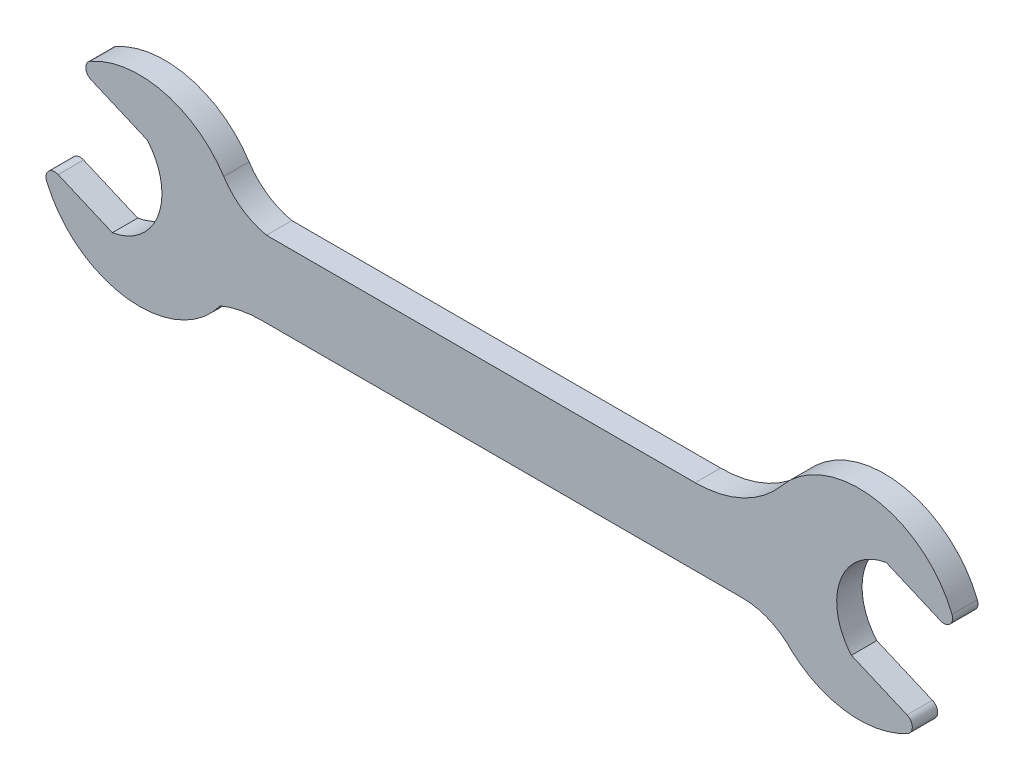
ISO-10303-21;
HEADER;
FILE_DESCRIPTION(('STEP AP214'),'2;1');
FILE_NAME('part.step','',(''),(''),'','','');
FILE_SCHEMA(('AUTOMOTIVE_DESIGN { 1 0 10303 214 1 1 1 1 }'));
ENDSEC;
DATA;
#1=APPLICATION_CONTEXT('core data for automotive mechanical design processes');
#2=APPLICATION_PROTOCOL_DEFINITION('international standard','automotive_design',2000,#1);
#3=PRODUCT_CONTEXT('',#1,'mechanical');
#4=PRODUCT('Part','Part','',(#3));
#5=PRODUCT_RELATED_PRODUCT_CATEGORY('part','',(#4));
#6=PRODUCT_DEFINITION_FORMATION('','',#4);
#7=PRODUCT_DEFINITION_CONTEXT('part definition',#1,'design');
#8=PRODUCT_DEFINITION('design','',#6,#7);
#9=PRODUCT_DEFINITION_SHAPE('','',#8);
#10=(LENGTH_UNIT() NAMED_UNIT(*) SI_UNIT(.MILLI.,.METRE.));
#11=(NAMED_UNIT(*) PLANE_ANGLE_UNIT() SI_UNIT($,.RADIAN.));
#12=(NAMED_UNIT(*) SI_UNIT($,.STERADIAN.) SOLID_ANGLE_UNIT());
#13=UNCERTAINTY_MEASURE_WITH_UNIT(LENGTH_MEASURE(1.E-05),#10,'distance_accuracy_value','');
#14=(GEOMETRIC_REPRESENTATION_CONTEXT(3) GLOBAL_UNCERTAINTY_ASSIGNED_CONTEXT((#13)) GLOBAL_UNIT_ASSIGNED_CONTEXT((#10,
#11,#12)) REPRESENTATION_CONTEXT('',''));
#15=CARTESIAN_POINT('',(0.,0.,0.));
#16=DIRECTION('',(0.,0.,1.));
#17=DIRECTION('',(1.,0.,0.));
#18=AXIS2_PLACEMENT_3D('',#15,#16,#17);
#19=CARTESIAN_POINT('',(66.7513893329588,243.610456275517,9.525));
#20=DIRECTION('',(0.,0.,-1.));
#21=DIRECTION('',(-1.,0.,0.));
#22=AXIS2_PLACEMENT_3D('',#19,#20,#21);
#23=CYLINDRICAL_SURFACE('',#22,75.26879536);
#24=CARTESIAN_POINT('',(66.7513893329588,243.610456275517,-9.525));
#25=DIRECTION('',(0.,0.,1.));
#26=DIRECTION('',(1.,0.,0.));
#27=AXIS2_PLACEMENT_3D('',#24,#25,#26);
#28=CIRCLE('',#27,75.26879536);
#29=CARTESIAN_POINT('',(16.9197315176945,187.199487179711,-9.525));
#30=VERTEX_POINT('',#29);
#31=CARTESIAN_POINT('',(103.374509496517,177.852273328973,-9.525));
#32=VERTEX_POINT('',#31);
#33=EDGE_CURVE('E172',#30,#32,#28,.T.);
#34=ORIENTED_EDGE('',*,*,#33,.T.);
#35=DIRECTION('',(0.,0.,-1.));
#36=VECTOR('',#35,1.);
#37=CARTESIAN_POINT('',(103.374509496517,177.852273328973,9.525));
#38=LINE('',#37,#36);
#39=CARTESIAN_POINT('',(103.374509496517,177.852273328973,9.525));
#40=VERTEX_POINT('',#39);
#41=EDGE_CURVE('E11',#40,#32,#38,.T.);
#42=ORIENTED_EDGE('',*,*,#41,.F.);
#43=CARTESIAN_POINT('',(66.7513893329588,243.610456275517,9.525));
#44=DIRECTION('',(0.,0.,1.));
#45=DIRECTION('',(1.,0.,0.));
#46=AXIS2_PLACEMENT_3D('',#43,#44,#45);
#47=CIRCLE('',#46,75.26879536);
#48=CARTESIAN_POINT('',(16.9197315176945,187.199487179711,9.525));
#49=VERTEX_POINT('',#48);
#50=EDGE_CURVE('E223',#49,#40,#47,.T.);
#51=ORIENTED_EDGE('',*,*,#50,.F.);
#52=DIRECTION('',(0.,0.,-1.));
#53=VECTOR('',#52,1.);
#54=CARTESIAN_POINT('',(16.9197315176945,187.199487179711,9.525));
#55=LINE('',#54,#53);
#56=EDGE_CURVE('E185',#49,#30,#55,.T.);
#57=ORIENTED_EDGE('',*,*,#56,.T.);
#58=EDGE_LOOP('',(#34,#42,#51,#57));
#59=FACE_BOUND('',#58,.T.);
#60=ADVANCED_FACE('F32',(#59),#23,.T.);
#61=CARTESIAN_POINT('',(100.189890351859,183.57037619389,9.525));
#62=DIRECTION('',(0.,0.,-1.));
#63=DIRECTION('',(-1.,0.,0.));
#64=AXIS2_PLACEMENT_3D('',#61,#62,#63);
#65=CYLINDRICAL_SURFACE('',#64,6.5451126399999);
#66=CARTESIAN_POINT('',(100.189890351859,183.57037619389,-9.525));
#67=DIRECTION('',(0.,0.,1.));
#68=DIRECTION('',(1.,0.,0.));
#69=AXIS2_PLACEMENT_3D('',#66,#67,#68);
#70=CIRCLE('',#69,6.5451126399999);
#71=CARTESIAN_POINT('',(102.76813653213,189.586283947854,-9.525));
#72=VERTEX_POINT('',#71);
#73=EDGE_CURVE('E168',#32,#72,#70,.T.);
#74=ORIENTED_EDGE('',*,*,#73,.T.);
#75=DIRECTION('',(0.,0.,-1.));
#76=VECTOR('',#75,1.);
#77=CARTESIAN_POINT('',(102.76813653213,189.586283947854,9.525));
#78=LINE('',#77,#76);
#79=CARTESIAN_POINT('',(102.76813653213,189.586283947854,9.525));
#80=VERTEX_POINT('',#79);
#81=EDGE_CURVE('E39',#80,#72,#78,.T.);
#82=ORIENTED_EDGE('',*,*,#81,.F.);
#83=CARTESIAN_POINT('',(100.189890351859,183.57037619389,9.525));
#84=DIRECTION('',(0.,0.,1.));
#85=DIRECTION('',(1.,0.,0.));
#86=AXIS2_PLACEMENT_3D('',#83,#84,#85);
#87=CIRCLE('',#86,6.5451126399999);
#88=EDGE_CURVE('E181',#40,#80,#87,.T.);
#89=ORIENTED_EDGE('',*,*,#88,.F.);
#90=ORIENTED_EDGE('',*,*,#41,.T.);
#91=EDGE_LOOP('',(#74,#82,#89,#90));
#92=FACE_BOUND('',#91,.T.);
#93=ADVANCED_FACE('F180',(#92),#65,.T.);
#94=CARTESIAN_POINT('',(61.0328374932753,207.472840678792,9.525));
#95=DIRECTION('',(-0.393919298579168,-0.919145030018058,0.));
#96=DIRECTION('',(0.919145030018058,-0.393919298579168,0.));
#97=AXIS2_PLACEMENT_3D('',#94,#95,#96);
#98=PLANE('',#97);
#99=DIRECTION('',(-0.919145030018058,0.393919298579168,0.));
#100=VECTOR('',#99,1.);
#101=CARTESIAN_POINT('',(61.0328374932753,207.472840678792,-9.525));
#102=LINE('',#101,#100);
#103=CARTESIAN_POINT('',(61.0328374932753,207.472840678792,-9.525));
#104=VERTEX_POINT('',#103);
#105=EDGE_CURVE('E174',#72,#104,#102,.T.);
#106=ORIENTED_EDGE('',*,*,#105,.T.);
#107=DIRECTION('',(0.,0.,-1.));
#108=VECTOR('',#107,1.);
#109=CARTESIAN_POINT('',(61.0328374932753,207.472840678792,9.525));
#110=LINE('',#109,#108);
#111=CARTESIAN_POINT('',(61.0328374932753,207.472840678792,9.525));
#112=VERTEX_POINT('',#111);
#113=EDGE_CURVE('E309',#112,#104,#110,.T.);
#114=ORIENTED_EDGE('',*,*,#113,.F.);
#115=DIRECTION('',(-0.919145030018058,0.393919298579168,0.));
#116=VECTOR('',#115,1.);
#117=CARTESIAN_POINT('',(61.0328374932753,207.472840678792,9.525));
#118=LINE('',#117,#116);
#119=EDGE_CURVE('E226',#80,#112,#118,.T.);
#120=ORIENTED_EDGE('',*,*,#119,.F.);
#121=ORIENTED_EDGE('',*,*,#81,.T.);
#122=EDGE_LOOP('',(#106,#114,#120,#121));
#123=FACE_BOUND('',#122,.T.);
#124=ADVANCED_FACE('F313',(#123),#98,.F.);
#125=CARTESIAN_POINT('',(94.5765397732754,236.84904688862,9.525));
#126=DIRECTION('',(0.,0.,-1.));
#127=DIRECTION('',(-1.,0.,0.));
#128=AXIS2_PLACEMENT_3D('',#125,#126,#127);
#129=CYLINDRICAL_SURFACE('',#128,44.5885798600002);
#130=CARTESIAN_POINT('',(94.5765397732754,236.84904688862,-9.525));
#131=DIRECTION('',(0.,0.,-1.));
#132=DIRECTION('',(1.,0.,0.));
#133=AXIS2_PLACEMENT_3D('',#130,#131,#132);
#134=CIRCLE('',#133,44.5885798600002);
#135=CARTESIAN_POINT('',(87.1923811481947,280.821943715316,-9.525));
#136=VERTEX_POINT('',#135);
#137=EDGE_CURVE('E189',#104,#136,#134,.T.);
#138=ORIENTED_EDGE('',*,*,#137,.T.);
#139=DIRECTION('',(0.,0.,-1.));
#140=VECTOR('',#139,1.);
#141=CARTESIAN_POINT('',(87.1923811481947,280.821943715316,9.525));
#142=LINE('',#141,#140);
#143=CARTESIAN_POINT('',(87.1923811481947,280.821943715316,9.525));
#144=VERTEX_POINT('',#143);
#145=EDGE_CURVE('E306',#144,#136,#142,.T.);
#146=ORIENTED_EDGE('',*,*,#145,.F.);
#147=CARTESIAN_POINT('',(94.5765397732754,236.84904688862,9.525));
#148=DIRECTION('',(0.,0.,-1.));
#149=DIRECTION('',(1.,0.,0.));
#150=AXIS2_PLACEMENT_3D('',#147,#148,#149);
#151=CIRCLE('',#150,44.5885798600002);
#152=EDGE_CURVE('E228',#112,#144,#151,.T.);
#153=ORIENTED_EDGE('',*,*,#152,.F.);
#154=ORIENTED_EDGE('',*,*,#113,.T.);
#155=EDGE_LOOP('',(#138,#146,#153,#154));
#156=FACE_BOUND('',#155,.T.);
#157=ADVANCED_FACE('F321',(#156),#129,.F.);
#158=CARTESIAN_POINT('',(87.1923811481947,280.821943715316,9.525));
#159=DIRECTION('',(0.393919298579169,0.919145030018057,0.));
#160=DIRECTION('',(-0.919145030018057,0.39391929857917,0.));
#161=AXIS2_PLACEMENT_3D('',#158,#159,#160);
#162=PLANE('',#161);
#163=DIRECTION('',(0.919145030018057,-0.39391929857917,0.));
#164=VECTOR('',#163,1.);
#165=CARTESIAN_POINT('',(87.1923811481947,280.821943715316,-9.525));
#166=LINE('',#165,#164);
#167=CARTESIAN_POINT('',(127.873018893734,263.387384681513,-9.525));
#168=VERTEX_POINT('',#167);
#169=EDGE_CURVE('E191',#136,#168,#166,.T.);
#170=ORIENTED_EDGE('',*,*,#169,.T.);
#171=DIRECTION('',(0.,0.,-1.));
#172=VECTOR('',#171,1.);
#173=CARTESIAN_POINT('',(127.873018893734,263.387384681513,9.525));
#174=LINE('',#173,#172);
#175=CARTESIAN_POINT('',(127.873018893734,263.387384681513,9.525));
#176=VERTEX_POINT('',#175);
#177=EDGE_CURVE('E303',#176,#168,#174,.T.);
#178=ORIENTED_EDGE('',*,*,#177,.F.);
#179=DIRECTION('',(0.919145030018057,-0.39391929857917,0.));
#180=VECTOR('',#179,1.);
#181=CARTESIAN_POINT('',(87.1923811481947,280.821943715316,9.525));
#182=LINE('',#181,#180);
#183=EDGE_CURVE('E230',#144,#176,#182,.T.);
#184=ORIENTED_EDGE('',*,*,#183,.F.);
#185=ORIENTED_EDGE('',*,*,#145,.T.);
#186=EDGE_LOOP('',(#170,#178,#184,#185));
#187=FACE_BOUND('',#186,.T.);
#188=ADVANCED_FACE('F324',(#187),#162,.F.);
#189=CARTESIAN_POINT('',(130.451265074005,269.403292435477,9.525));
#190=DIRECTION('',(0.,0.,-1.));
#191=DIRECTION('',(-1.,0.,0.));
#192=AXIS2_PLACEMENT_3D('',#189,#190,#191);
#193=CYLINDRICAL_SURFACE('',#192,6.54511263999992);
#194=CARTESIAN_POINT('',(130.451265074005,269.403292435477,-9.525));
#195=DIRECTION('',(0.,0.,1.));
#196=DIRECTION('',(-1.,0.,0.));
#197=AXIS2_PLACEMENT_3D('',#194,#195,#196);
#198=CIRCLE('',#197,6.54511263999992);
#199=CARTESIAN_POINT('',(136.517919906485,271.85975302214,-9.525));
#200=VERTEX_POINT('',#199);
#201=EDGE_CURVE('E193',#168,#200,#198,.T.);
#202=ORIENTED_EDGE('',*,*,#201,.T.);
#203=DIRECTION('',(0.,0.,-1.));
#204=VECTOR('',#203,1.);
#205=CARTESIAN_POINT('',(136.517919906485,271.85975302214,9.525));
#206=LINE('',#205,#204);
#207=CARTESIAN_POINT('',(136.517919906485,271.85975302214,9.525));
#208=VERTEX_POINT('',#207);
#209=EDGE_CURVE('E300',#208,#200,#206,.T.);
#210=ORIENTED_EDGE('',*,*,#209,.F.);
#211=CARTESIAN_POINT('',(130.451265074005,269.403292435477,9.525));
#212=DIRECTION('',(0.,0.,1.));
#213=DIRECTION('',(-1.,0.,0.));
#214=AXIS2_PLACEMENT_3D('',#211,#212,#213);
#215=CIRCLE('',#214,6.54511263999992);
#216=EDGE_CURVE('E232',#176,#208,#215,.T.);
#217=ORIENTED_EDGE('',*,*,#216,.F.);
#218=ORIENTED_EDGE('',*,*,#177,.T.);
#219=EDGE_LOOP('',(#202,#210,#217,#218));
#220=FACE_BOUND('',#219,.T.);
#221=ADVANCED_FACE('F329',(#220),#193,.T.);
#222=CARTESIAN_POINT('',(66.7513893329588,243.610456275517,9.525));
#223=DIRECTION('',(0.,0.,-1.));
#224=DIRECTION('',(-1.,0.,0.));
#225=AXIS2_PLACEMENT_3D('',#222,#223,#224);
#226=CYLINDRICAL_SURFACE('',#225,75.26879536);
#227=CARTESIAN_POINT('',(66.7513893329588,243.610456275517,-9.525));
#228=DIRECTION('',(0.,0.,1.));
#229=DIRECTION('',(1.,0.,0.));
#230=AXIS2_PLACEMENT_3D('',#227,#228,#229);
#231=CIRCLE('',#230,75.26879536);
#232=CARTESIAN_POINT('',(8.74176367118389,291.571637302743,-9.525));
#233=VERTEX_POINT('',#232);
#234=EDGE_CURVE('E195',#200,#233,#231,.T.);
#235=ORIENTED_EDGE('',*,*,#234,.T.);
#236=DIRECTION('',(0.,0.,-1.));
#237=VECTOR('',#236,1.);
#238=CARTESIAN_POINT('',(8.74176367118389,291.571637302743,9.525));
#239=LINE('',#238,#237);
#240=CARTESIAN_POINT('',(8.74176367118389,291.571637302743,9.525));
#241=VERTEX_POINT('',#240);
#242=EDGE_CURVE('E297',#241,#233,#239,.T.);
#243=ORIENTED_EDGE('',*,*,#242,.F.);
#244=CARTESIAN_POINT('',(66.7513893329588,243.610456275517,9.525));
#245=DIRECTION('',(0.,0.,1.));
#246=DIRECTION('',(1.,0.,0.));
#247=AXIS2_PLACEMENT_3D('',#244,#245,#246);
#248=CIRCLE('',#247,75.26879536);
#249=EDGE_CURVE('E234',#208,#241,#248,.T.);
#250=ORIENTED_EDGE('',*,*,#249,.F.);
#251=ORIENTED_EDGE('',*,*,#209,.T.);
#252=EDGE_LOOP('',(#235,#243,#250,#251));
#253=FACE_BOUND('',#252,.T.);
#254=ADVANCED_FACE('F335',(#253),#226,.T.);
#255=CARTESIAN_POINT('',(-56.2037954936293,345.267307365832,9.525));
#256=DIRECTION('',(0.,0.,-1.));
#257=DIRECTION('',(-1.,0.,0.));
#258=AXIS2_PLACEMENT_3D('',#255,#256,#257);
#259=CYLINDRICAL_SURFACE('',#258,84.26832524);
#260=CARTESIAN_POINT('',(-56.2037954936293,345.267307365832,-9.525));
#261=DIRECTION('',(0.,0.,-1.));
#262=DIRECTION('',(1.,0.,0.));
#263=AXIS2_PLACEMENT_3D('',#260,#261,#262);
#264=CIRCLE('',#263,84.26832524);
#265=CARTESIAN_POINT('',(-56.2037954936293,260.998982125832,-9.525));
#266=VERTEX_POINT('',#265);
#267=EDGE_CURVE('E197',#233,#266,#264,.T.);
#268=ORIENTED_EDGE('',*,*,#267,.T.);
#269=DIRECTION('',(0.,0.,-1.));
#270=VECTOR('',#269,1.);
#271=CARTESIAN_POINT('',(-56.2037954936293,260.998982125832,9.525));
#272=LINE('',#271,#270);
#273=CARTESIAN_POINT('',(-56.2037954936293,260.998982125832,9.525));
#274=VERTEX_POINT('',#273);
#275=EDGE_CURVE('E294',#274,#266,#272,.T.);
#276=ORIENTED_EDGE('',*,*,#275,.F.);
#277=CARTESIAN_POINT('',(-56.2037954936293,345.267307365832,9.525));
#278=DIRECTION('',(0.,0.,-1.));
#279=DIRECTION('',(1.,0.,0.));
#280=AXIS2_PLACEMENT_3D('',#277,#278,#279);
#281=CIRCLE('',#280,84.26832524);
#282=EDGE_CURVE('E236',#241,#274,#281,.T.);
#283=ORIENTED_EDGE('',*,*,#282,.F.);
#284=ORIENTED_EDGE('',*,*,#242,.T.);
#285=EDGE_LOOP('',(#268,#276,#283,#284));
#286=FACE_BOUND('',#285,.T.);
#287=ADVANCED_FACE('F339',(#286),#259,.F.);
#288=CARTESIAN_POINT('',(-56.2037954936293,260.998982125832,9.525));
#289=DIRECTION('',(0.,-1.,0.));
#290=DIRECTION('',(0.,0.,-1.));
#291=AXIS2_PLACEMENT_3D('',#288,#289,#290);
#292=PLANE('',#291);
#293=DIRECTION('',(-1.,0.,0.));
#294=VECTOR('',#293,1.);
#295=CARTESIAN_POINT('',(-56.2037954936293,260.998982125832,-9.525));
#296=LINE('',#295,#294);
#297=CARTESIAN_POINT('',(-377.964028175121,260.998982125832,-9.525));
#298=VERTEX_POINT('',#297);
#299=EDGE_CURVE('E199',#266,#298,#296,.T.);
#300=ORIENTED_EDGE('',*,*,#299,.T.);
#301=DIRECTION('',(0.,0.,-1.));
#302=VECTOR('',#301,1.);
#303=CARTESIAN_POINT('',(-377.964028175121,260.998982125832,9.525));
#304=LINE('',#303,#302);
#305=CARTESIAN_POINT('',(-377.964028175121,260.998982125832,9.525));
#306=VERTEX_POINT('',#305);
#307=EDGE_CURVE('E291',#306,#298,#304,.T.);
#308=ORIENTED_EDGE('',*,*,#307,.F.);
#309=DIRECTION('',(-1.,0.,0.));
#310=VECTOR('',#309,1.);
#311=CARTESIAN_POINT('',(-56.2037954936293,260.998982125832,9.525));
#312=LINE('',#311,#310);
#313=EDGE_CURVE('E238',#274,#306,#312,.T.);
#314=ORIENTED_EDGE('',*,*,#313,.F.);
#315=ORIENTED_EDGE('',*,*,#275,.T.);
#316=EDGE_LOOP('',(#300,#308,#314,#315));
#317=FACE_BOUND('',#316,.T.);
#318=ADVANCED_FACE('F344',(#317),#292,.F.);
#319=CARTESIAN_POINT('',(-367.379563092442,310.607010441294,9.525));
#320=DIRECTION('',(0.,0.,-1.));
#321=DIRECTION('',(-1.,0.,0.));
#322=AXIS2_PLACEMENT_3D('',#319,#320,#321);
#323=CYLINDRICAL_SURFACE('',#322,50.7246229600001);
#324=CARTESIAN_POINT('',(-367.379563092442,310.607010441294,-9.525));
#325=DIRECTION('',(0.,0.,-1.));
#326=DIRECTION('',(-1.,0.,0.));
#327=AXIS2_PLACEMENT_3D('',#324,#325,#326);
#328=CIRCLE('',#327,50.7246229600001);
#329=CARTESIAN_POINT('',(-410.010391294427,283.118833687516,-9.525));
#330=VERTEX_POINT('',#329);
#331=EDGE_CURVE('E201',#298,#330,#328,.T.);
#332=ORIENTED_EDGE('',*,*,#331,.T.);
#333=DIRECTION('',(0.,0.,-1.));
#334=VECTOR('',#333,1.);
#335=CARTESIAN_POINT('',(-410.010391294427,283.118833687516,9.525));
#336=LINE('',#335,#334);
#337=CARTESIAN_POINT('',(-410.010391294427,283.118833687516,9.525));
#338=VERTEX_POINT('',#337);
#339=EDGE_CURVE('E288',#338,#330,#336,.T.);
#340=ORIENTED_EDGE('',*,*,#339,.F.);
#341=CARTESIAN_POINT('',(-367.379563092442,310.607010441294,9.525));
#342=DIRECTION('',(0.,0.,-1.));
#343=DIRECTION('',(-1.,0.,0.));
#344=AXIS2_PLACEMENT_3D('',#341,#342,#343);
#345=CIRCLE('',#344,50.7246229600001);
#346=EDGE_CURVE('E240',#306,#338,#345,.T.);
#347=ORIENTED_EDGE('',*,*,#346,.F.);
#348=ORIENTED_EDGE('',*,*,#307,.T.);
#349=EDGE_LOOP('',(#332,#340,#347,#348));
#350=FACE_BOUND('',#349,.T.);
#351=ADVANCED_FACE('F350',(#350),#323,.F.);
#352=CARTESIAN_POINT('',(-473.269039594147,242.329926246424,9.525));
#353=DIRECTION('',(0.,0.,-1.));
#354=DIRECTION('',(-1.,0.,0.));
#355=AXIS2_PLACEMENT_3D('',#352,#353,#354);
#356=CYLINDRICAL_SURFACE('',#355,75.2687953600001);
#357=CARTESIAN_POINT('',(-473.269039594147,242.329926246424,-9.525));
#358=DIRECTION('',(0.,0.,1.));
#359=DIRECTION('',(1.,0.,0.));
#360=AXIS2_PLACEMENT_3D('',#357,#358,#359);
#361=CIRCLE('',#360,75.2687953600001);
#362=CARTESIAN_POINT('',(-509.892159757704,308.088109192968,-9.525));
#363=VERTEX_POINT('',#362);
#364=EDGE_CURVE('E203',#330,#363,#361,.T.);
#365=ORIENTED_EDGE('',*,*,#364,.T.);
#366=DIRECTION('',(0.,0.,-1.));
#367=VECTOR('',#366,1.);
#368=CARTESIAN_POINT('',(-509.892159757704,308.088109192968,9.525));
#369=LINE('',#368,#367);
#370=CARTESIAN_POINT('',(-509.892159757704,308.088109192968,9.525));
#371=VERTEX_POINT('',#370);
#372=EDGE_CURVE('E285',#371,#363,#369,.T.);
#373=ORIENTED_EDGE('',*,*,#372,.F.);
#374=CARTESIAN_POINT('',(-473.269039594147,242.329926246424,9.525));
#375=DIRECTION('',(0.,0.,1.));
#376=DIRECTION('',(1.,0.,0.));
#377=AXIS2_PLACEMENT_3D('',#374,#375,#376);
#378=CIRCLE('',#377,75.2687953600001);
#379=EDGE_CURVE('E242',#338,#371,#378,.T.);
#380=ORIENTED_EDGE('',*,*,#379,.F.);
#381=ORIENTED_EDGE('',*,*,#339,.T.);
#382=EDGE_LOOP('',(#365,#373,#380,#381));
#383=FACE_BOUND('',#382,.T.);
#384=ADVANCED_FACE('F354',(#383),#356,.T.);
#385=CARTESIAN_POINT('',(-506.992451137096,302.220384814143,9.525));
#386=DIRECTION('',(0.,0.,-1.));
#387=DIRECTION('',(-1.,0.,0.));
#388=AXIS2_PLACEMENT_3D('',#385,#386,#387);
#389=CYLINDRICAL_SURFACE('',#388,6.54511264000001);
#390=CARTESIAN_POINT('',(-506.992451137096,302.220384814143,-9.525));
#391=DIRECTION('',(0.,0.,1.));
#392=DIRECTION('',(1.,0.,0.));
#393=AXIS2_PLACEMENT_3D('',#390,#391,#392);
#394=CIRCLE('',#393,6.54511264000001);
#395=CARTESIAN_POINT('',(-509.570697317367,296.204477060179,-9.525));
#396=VERTEX_POINT('',#395);
#397=EDGE_CURVE('E205',#363,#396,#394,.T.);
#398=ORIENTED_EDGE('',*,*,#397,.T.);
#399=DIRECTION('',(0.,0.,-1.));
#400=VECTOR('',#399,1.);
#401=CARTESIAN_POINT('',(-509.570697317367,296.204477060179,9.525));
#402=LINE('',#401,#400);
#403=CARTESIAN_POINT('',(-509.570697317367,296.204477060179,9.525));
#404=VERTEX_POINT('',#403);
#405=EDGE_CURVE('E282',#404,#396,#402,.T.);
#406=ORIENTED_EDGE('',*,*,#405,.F.);
#407=CARTESIAN_POINT('',(-506.992451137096,302.220384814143,9.525));
#408=DIRECTION('',(0.,0.,1.));
#409=DIRECTION('',(1.,0.,0.));
#410=AXIS2_PLACEMENT_3D('',#407,#408,#409);
#411=CIRCLE('',#410,6.54511264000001);
#412=EDGE_CURVE('E244',#371,#404,#411,.T.);
#413=ORIENTED_EDGE('',*,*,#412,.F.);
#414=ORIENTED_EDGE('',*,*,#372,.T.);
#415=EDGE_LOOP('',(#398,#406,#413,#414));
#416=FACE_BOUND('',#415,.T.);
#417=ADVANCED_FACE('F359',(#416),#389,.T.);
#418=CARTESIAN_POINT('',(-467.416264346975,278.138291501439,9.525));
#419=DIRECTION('',(0.393919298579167,0.919145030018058,0.));
#420=DIRECTION('',(-0.919145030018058,0.393919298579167,0.));
#421=AXIS2_PLACEMENT_3D('',#418,#419,#420);
#422=PLANE('',#421);
#423=DIRECTION('',(0.919145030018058,-0.393919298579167,0.));
#424=VECTOR('',#423,1.);
#425=CARTESIAN_POINT('',(-467.416264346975,278.138291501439,-9.525));
#426=LINE('',#425,#424);
#427=CARTESIAN_POINT('',(-467.416264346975,278.138291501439,-9.525));
#428=VERTEX_POINT('',#427);
#429=EDGE_CURVE('E207',#396,#428,#426,.T.);
#430=ORIENTED_EDGE('',*,*,#429,.T.);
#431=DIRECTION('',(0.,0.,-1.));
#432=VECTOR('',#431,1.);
#433=CARTESIAN_POINT('',(-467.416264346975,278.138291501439,9.525));
#434=LINE('',#433,#432);
#435=CARTESIAN_POINT('',(-467.416264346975,278.138291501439,9.525));
#436=VERTEX_POINT('',#435);
#437=EDGE_CURVE('E279',#436,#428,#434,.T.);
#438=ORIENTED_EDGE('',*,*,#437,.F.);
#439=DIRECTION('',(0.919145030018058,-0.393919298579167,0.));
#440=VECTOR('',#439,1.);
#441=CARTESIAN_POINT('',(-467.416264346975,278.138291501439,9.525));
#442=LINE('',#441,#440);
#443=EDGE_CURVE('E246',#404,#436,#442,.T.);
#444=ORIENTED_EDGE('',*,*,#443,.F.);
#445=ORIENTED_EDGE('',*,*,#405,.T.);
#446=EDGE_LOOP('',(#430,#438,#444,#445));
#447=FACE_BOUND('',#446,.T.);
#448=ADVANCED_FACE('F365',(#447),#422,.F.);
#449=CARTESIAN_POINT('',(-500.959966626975,248.762085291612,9.525));
#450=DIRECTION('',(0.,0.,-1.));
#451=DIRECTION('',(-1.,0.,0.));
#452=AXIS2_PLACEMENT_3D('',#449,#450,#451);
#453=CYLINDRICAL_SURFACE('',#452,44.5885798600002);
#454=CARTESIAN_POINT('',(-500.959966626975,248.762085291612,-9.525));
#455=DIRECTION('',(0.,0.,-1.));
#456=DIRECTION('',(1.,0.,0.));
#457=AXIS2_PLACEMENT_3D('',#454,#455,#456);
#458=CIRCLE('',#457,44.5885798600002);
#459=CARTESIAN_POINT('',(-493.575808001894,204.789188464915,-9.525));
#460=VERTEX_POINT('',#459);
#461=EDGE_CURVE('E209',#428,#460,#458,.T.);
#462=ORIENTED_EDGE('',*,*,#461,.T.);
#463=DIRECTION('',(0.,0.,-1.));
#464=VECTOR('',#463,1.);
#465=CARTESIAN_POINT('',(-493.575808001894,204.789188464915,9.525));
#466=LINE('',#465,#464);
#467=CARTESIAN_POINT('',(-493.575808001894,204.789188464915,9.525));
#468=VERTEX_POINT('',#467);
#469=EDGE_CURVE('E276',#468,#460,#466,.T.);
#470=ORIENTED_EDGE('',*,*,#469,.F.);
#471=CARTESIAN_POINT('',(-500.959966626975,248.762085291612,9.525));
#472=DIRECTION('',(0.,0.,-1.));
#473=DIRECTION('',(1.,0.,0.));
#474=AXIS2_PLACEMENT_3D('',#471,#472,#473);
#475=CIRCLE('',#474,44.5885798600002);
#476=EDGE_CURVE('E248',#436,#468,#475,.T.);
#477=ORIENTED_EDGE('',*,*,#476,.F.);
#478=ORIENTED_EDGE('',*,*,#437,.T.);
#479=EDGE_LOOP('',(#462,#470,#477,#478));
#480=FACE_BOUND('',#479,.T.);
#481=ADVANCED_FACE('F369',(#480),#453,.F.);
#482=CARTESIAN_POINT('',(-493.575808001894,204.789188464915,9.525));
#483=DIRECTION('',(-0.39391929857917,-0.919145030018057,0.));
#484=DIRECTION('',(0.919145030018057,-0.39391929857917,0.));
#485=AXIS2_PLACEMENT_3D('',#482,#483,#484);
#486=PLANE('',#485);
#487=DIRECTION('',(-0.919145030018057,0.39391929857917,0.));
#488=VECTOR('',#487,1.);
#489=CARTESIAN_POINT('',(-493.575808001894,204.789188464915,-9.525));
#490=LINE('',#489,#488);
#491=CARTESIAN_POINT('',(-534.256445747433,222.223747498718,-9.525));
#492=VERTEX_POINT('',#491);
#493=EDGE_CURVE('E211',#460,#492,#490,.T.);
#494=ORIENTED_EDGE('',*,*,#493,.T.);
#495=DIRECTION('',(0.,0.,-1.));
#496=VECTOR('',#495,1.);
#497=CARTESIAN_POINT('',(-534.256445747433,222.223747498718,9.525));
#498=LINE('',#497,#496);
#499=CARTESIAN_POINT('',(-534.256445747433,222.223747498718,9.525));
#500=VERTEX_POINT('',#499);
#501=EDGE_CURVE('E273',#500,#492,#498,.T.);
#502=ORIENTED_EDGE('',*,*,#501,.F.);
#503=DIRECTION('',(-0.919145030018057,0.39391929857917,0.));
#504=VECTOR('',#503,1.);
#505=CARTESIAN_POINT('',(-493.575808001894,204.789188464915,9.525));
#506=LINE('',#505,#504);
#507=EDGE_CURVE('E250',#468,#500,#506,.T.);
#508=ORIENTED_EDGE('',*,*,#507,.F.);
#509=ORIENTED_EDGE('',*,*,#469,.T.);
#510=EDGE_LOOP('',(#494,#502,#508,#509));
#511=FACE_BOUND('',#510,.T.);
#512=ADVANCED_FACE('F374',(#511),#486,.F.);
#513=CARTESIAN_POINT('',(-536.834691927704,216.207839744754,9.525));
#514=DIRECTION('',(0.,0.,-1.));
#515=DIRECTION('',(-1.,0.,0.));
#516=AXIS2_PLACEMENT_3D('',#513,#514,#515);
#517=CYLINDRICAL_SURFACE('',#516,6.54511263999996);
#518=CARTESIAN_POINT('',(-536.834691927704,216.207839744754,-9.525));
#519=DIRECTION('',(0.,0.,1.));
#520=DIRECTION('',(-1.,0.,0.));
#521=AXIS2_PLACEMENT_3D('',#518,#519,#520);
#522=CIRCLE('',#521,6.54511263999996);
#523=CARTESIAN_POINT('',(-542.901346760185,213.751379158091,-9.525));
#524=VERTEX_POINT('',#523);
#525=EDGE_CURVE('E213',#492,#524,#522,.T.);
#526=ORIENTED_EDGE('',*,*,#525,.T.);
#527=DIRECTION('',(0.,0.,-1.));
#528=VECTOR('',#527,1.);
#529=CARTESIAN_POINT('',(-542.901346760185,213.751379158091,9.525));
#530=LINE('',#529,#528);
#531=CARTESIAN_POINT('',(-542.901346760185,213.751379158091,9.525));
#532=VERTEX_POINT('',#531);
#533=EDGE_CURVE('E270',#532,#524,#530,.T.);
#534=ORIENTED_EDGE('',*,*,#533,.F.);
#535=CARTESIAN_POINT('',(-536.834691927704,216.207839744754,9.525));
#536=DIRECTION('',(0.,0.,1.));
#537=DIRECTION('',(-1.,0.,0.));
#538=AXIS2_PLACEMENT_3D('',#535,#536,#537);
#539=CIRCLE('',#538,6.54511263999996);
#540=EDGE_CURVE('E252',#500,#532,#539,.T.);
#541=ORIENTED_EDGE('',*,*,#540,.F.);
#542=ORIENTED_EDGE('',*,*,#501,.T.);
#543=EDGE_LOOP('',(#526,#534,#541,#542));
#544=FACE_BOUND('',#543,.T.);
#545=ADVANCED_FACE('F380',(#544),#517,.T.);
#546=CARTESIAN_POINT('',(-473.269039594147,242.329926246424,9.525));
#547=DIRECTION('',(0.,0.,-1.));
#548=DIRECTION('',(-1.,0.,0.));
#549=AXIS2_PLACEMENT_3D('',#546,#547,#548);
#550=CYLINDRICAL_SURFACE('',#549,75.2687953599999);
#551=CARTESIAN_POINT('',(-473.269039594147,242.329926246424,-9.525));
#552=DIRECTION('',(0.,0.,1.));
#553=DIRECTION('',(1.,0.,0.));
#554=AXIS2_PLACEMENT_3D('',#551,#552,#553);
#555=CIRCLE('',#554,75.2687953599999);
#556=CARTESIAN_POINT('',(-412.543568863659,197.857364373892,-9.525));
#557=VERTEX_POINT('',#556);
#558=EDGE_CURVE('E215',#524,#557,#555,.T.);
#559=ORIENTED_EDGE('',*,*,#558,.T.);
#560=DIRECTION('',(0.,0.,-1.));
#561=VECTOR('',#560,1.);
#562=CARTESIAN_POINT('',(-412.543568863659,197.857364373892,9.525));
#563=LINE('',#562,#561);
#564=CARTESIAN_POINT('',(-412.543568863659,197.857364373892,9.525));
#565=VERTEX_POINT('',#564);
#566=EDGE_CURVE('E267',#565,#557,#563,.T.);
#567=ORIENTED_EDGE('',*,*,#566,.F.);
#568=CARTESIAN_POINT('',(-473.269039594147,242.329926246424,9.525));
#569=DIRECTION('',(0.,0.,1.));
#570=DIRECTION('',(1.,0.,0.));
#571=AXIS2_PLACEMENT_3D('',#568,#569,#570);
#572=CIRCLE('',#571,75.2687953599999);
#573=EDGE_CURVE('E254',#532,#565,#572,.T.);
#574=ORIENTED_EDGE('',*,*,#573,.F.);
#575=ORIENTED_EDGE('',*,*,#533,.T.);
#576=EDGE_LOOP('',(#559,#567,#574,#575));
#577=FACE_BOUND('',#576,.T.);
#578=ADVANCED_FACE('F384',(#577),#550,.T.);
#579=CARTESIAN_POINT('',(-381.336074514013,119.580656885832,9.525));
#580=DIRECTION('',(0.,0.,-1.));
#581=DIRECTION('',(-1.,0.,0.));
#582=AXIS2_PLACEMENT_3D('',#579,#580,#581);
#583=CYLINDRICAL_SURFACE('',#582,84.2683252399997);
#584=CARTESIAN_POINT('',(-381.336074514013,119.580656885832,-9.525));
#585=DIRECTION('',(0.,0.,-1.));
#586=DIRECTION('',(1.,0.,0.));
#587=AXIS2_PLACEMENT_3D('',#584,#585,#586);
#588=CIRCLE('',#587,84.2683252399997);
#589=CARTESIAN_POINT('',(-381.336074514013,203.848982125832,-9.525));
#590=VERTEX_POINT('',#589);
#591=EDGE_CURVE('E217',#557,#590,#588,.T.);
#592=ORIENTED_EDGE('',*,*,#591,.T.);
#593=DIRECTION('',(0.,0.,-1.));
#594=VECTOR('',#593,1.);
#595=CARTESIAN_POINT('',(-381.336074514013,203.848982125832,9.525));
#596=LINE('',#595,#594);
#597=CARTESIAN_POINT('',(-381.336074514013,203.848982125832,9.525));
#598=VERTEX_POINT('',#597);
#599=EDGE_CURVE('E264',#598,#590,#596,.T.);
#600=ORIENTED_EDGE('',*,*,#599,.F.);
#601=CARTESIAN_POINT('',(-381.336074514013,119.580656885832,9.525));
#602=DIRECTION('',(0.,0.,-1.));
#603=DIRECTION('',(1.,0.,0.));
#604=AXIS2_PLACEMENT_3D('',#601,#602,#603);
#605=CIRCLE('',#604,84.2683252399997);
#606=EDGE_CURVE('E256',#565,#598,#605,.T.);
#607=ORIENTED_EDGE('',*,*,#606,.F.);
#608=ORIENTED_EDGE('',*,*,#566,.T.);
#609=EDGE_LOOP('',(#592,#600,#607,#608));
#610=FACE_BOUND('',#609,.T.);
#611=ADVANCED_FACE('F389',(#610),#583,.F.);
#612=CARTESIAN_POINT('',(-381.336074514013,203.848982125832,9.525));
#613=DIRECTION('',(0.,1.,0.));
#614=DIRECTION('',(-1.,0.,0.));
#615=AXIS2_PLACEMENT_3D('',#612,#613,#614);
#616=PLANE('',#615);
#617=DIRECTION('',(1.,0.,0.));
#618=VECTOR('',#617,1.);
#619=CARTESIAN_POINT('',(-381.336074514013,203.848982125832,-9.525));
#620=LINE('',#619,#618);
#621=CARTESIAN_POINT('',(-20.6551673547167,203.848982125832,-9.525));
#622=VERTEX_POINT('',#621);
#623=EDGE_CURVE('E219',#590,#622,#620,.T.);
#624=ORIENTED_EDGE('',*,*,#623,.T.);
#625=DIRECTION('',(0.,0.,-1.));
#626=VECTOR('',#625,1.);
#627=CARTESIAN_POINT('',(-20.6551673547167,203.848982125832,9.525));
#628=LINE('',#627,#626);
#629=CARTESIAN_POINT('',(-20.6551673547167,203.848982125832,9.525));
#630=VERTEX_POINT('',#629);
#631=EDGE_CURVE('E261',#630,#622,#628,.T.);
#632=ORIENTED_EDGE('',*,*,#631,.F.);
#633=DIRECTION('',(1.,0.,0.));
#634=VECTOR('',#633,1.);
#635=CARTESIAN_POINT('',(-381.336074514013,203.848982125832,9.525));
#636=LINE('',#635,#634);
#637=EDGE_CURVE('E51',#598,#630,#636,.T.);
#638=ORIENTED_EDGE('',*,*,#637,.F.);
#639=ORIENTED_EDGE('',*,*,#599,.T.);
#640=EDGE_LOOP('',(#624,#632,#638,#639));
#641=FACE_BOUND('',#640,.T.);
#642=ADVANCED_FACE('F392',(#641),#616,.F.);
#643=CARTESIAN_POINT('',(-20.6551673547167,153.124359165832,9.525));
#644=DIRECTION('',(0.,0.,-1.));
#645=DIRECTION('',(-1.,0.,0.));
#646=AXIS2_PLACEMENT_3D('',#643,#644,#645);
#647=CYLINDRICAL_SURFACE('',#646,50.7246229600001);
#648=CARTESIAN_POINT('',(-20.6551673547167,153.124359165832,-9.525));
#649=DIRECTION('',(0.,0.,-1.));
#650=DIRECTION('',(-1.,0.,0.));
#651=AXIS2_PLACEMENT_3D('',#648,#649,#650);
#652=CIRCLE('',#651,50.7246229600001);
#653=EDGE_CURVE('E221',#622,#30,#652,.T.);
#654=ORIENTED_EDGE('',*,*,#653,.T.);
#655=ORIENTED_EDGE('',*,*,#56,.F.);
#656=CARTESIAN_POINT('',(-20.6551673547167,153.124359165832,9.525));
#657=DIRECTION('',(0.,0.,-1.));
#658=DIRECTION('',(-1.,0.,0.));
#659=AXIS2_PLACEMENT_3D('',#656,#657,#658);
#660=CIRCLE('',#659,50.7246229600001);
#661=EDGE_CURVE('E46',#630,#49,#660,.T.);
#662=ORIENTED_EDGE('',*,*,#661,.F.);
#663=ORIENTED_EDGE('',*,*,#631,.T.);
#664=EDGE_LOOP('',(#654,#655,#662,#663));
#665=FACE_BOUND('',#664,.T.);
#666=ADVANCED_FACE('F394',(#665),#647,.F.);
#667=CARTESIAN_POINT('',(66.7513893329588,243.610456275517,9.525));
#668=DIRECTION('',(0.,0.,1.));
#669=DIRECTION('',(1.,0.,0.));
#670=AXIS2_PLACEMENT_3D('',#667,#668,#669);
#671=PLANE('',#670);
#672=ORIENTED_EDGE('',*,*,#50,.T.);
#673=ORIENTED_EDGE('',*,*,#88,.T.);
#674=ORIENTED_EDGE('',*,*,#119,.T.);
#675=ORIENTED_EDGE('',*,*,#152,.T.);
#676=ORIENTED_EDGE('',*,*,#183,.T.);
#677=ORIENTED_EDGE('',*,*,#216,.T.);
#678=ORIENTED_EDGE('',*,*,#249,.T.);
#679=ORIENTED_EDGE('',*,*,#282,.T.);
#680=ORIENTED_EDGE('',*,*,#313,.T.);
#681=ORIENTED_EDGE('',*,*,#346,.T.);
#682=ORIENTED_EDGE('',*,*,#379,.T.);
#683=ORIENTED_EDGE('',*,*,#412,.T.);
#684=ORIENTED_EDGE('',*,*,#443,.T.);
#685=ORIENTED_EDGE('',*,*,#476,.T.);
#686=ORIENTED_EDGE('',*,*,#507,.T.);
#687=ORIENTED_EDGE('',*,*,#540,.T.);
#688=ORIENTED_EDGE('',*,*,#573,.T.);
#689=ORIENTED_EDGE('',*,*,#606,.T.);
#690=ORIENTED_EDGE('',*,*,#637,.T.);
#691=ORIENTED_EDGE('',*,*,#661,.T.);
#692=EDGE_LOOP('',(#672,#673,#674,#675,#676,#677,#678,#679,#680,#681,#682,#683,#684,#685,#686,
#687,#688,#689,#690,#691));
#693=FACE_BOUND('',#692,.T.);
#694=ADVANCED_FACE('F316',(#693),#671,.T.);
#695=CARTESIAN_POINT('',(66.7513893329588,243.610456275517,-9.525));
#696=DIRECTION('',(0.,0.,1.));
#697=DIRECTION('',(1.,0.,0.));
#698=AXIS2_PLACEMENT_3D('',#695,#696,#697);
#699=PLANE('',#698);
#700=ORIENTED_EDGE('',*,*,#33,.F.);
#701=ORIENTED_EDGE('',*,*,#653,.F.);
#702=ORIENTED_EDGE('',*,*,#623,.F.);
#703=ORIENTED_EDGE('',*,*,#591,.F.);
#704=ORIENTED_EDGE('',*,*,#558,.F.);
#705=ORIENTED_EDGE('',*,*,#525,.F.);
#706=ORIENTED_EDGE('',*,*,#493,.F.);
#707=ORIENTED_EDGE('',*,*,#461,.F.);
#708=ORIENTED_EDGE('',*,*,#429,.F.);
#709=ORIENTED_EDGE('',*,*,#397,.F.);
#710=ORIENTED_EDGE('',*,*,#364,.F.);
#711=ORIENTED_EDGE('',*,*,#331,.F.);
#712=ORIENTED_EDGE('',*,*,#299,.F.);
#713=ORIENTED_EDGE('',*,*,#267,.F.);
#714=ORIENTED_EDGE('',*,*,#234,.F.);
#715=ORIENTED_EDGE('',*,*,#201,.F.);
#716=ORIENTED_EDGE('',*,*,#169,.F.);
#717=ORIENTED_EDGE('',*,*,#137,.F.);
#718=ORIENTED_EDGE('',*,*,#105,.F.);
#719=ORIENTED_EDGE('',*,*,#73,.F.);
#720=EDGE_LOOP('',(#700,#701,#702,#703,#704,#705,#706,#707,#708,#709,#710,#711,#712,#713,#714,
#715,#716,#717,#718,#719));
#721=FACE_BOUND('',#720,.T.);
#722=ADVANCED_FACE('F169',(#721),#699,.F.);
#723=CLOSED_SHELL('',(#60,#93,#124,#157,#188,#221,#254,#287,#318,#351,#384,#417,#448,#481,#512,
#545,#578,#611,#642,#666,#694,#722));
#724=MANIFOLD_SOLID_BREP('B2',#723);
#725=ADVANCED_BREP_SHAPE_REPRESENTATION('',(#18,#724),#14);
#726=SHAPE_DEFINITION_REPRESENTATION(#9,#725);
ENDSEC;
END-ISO-10303-21;
